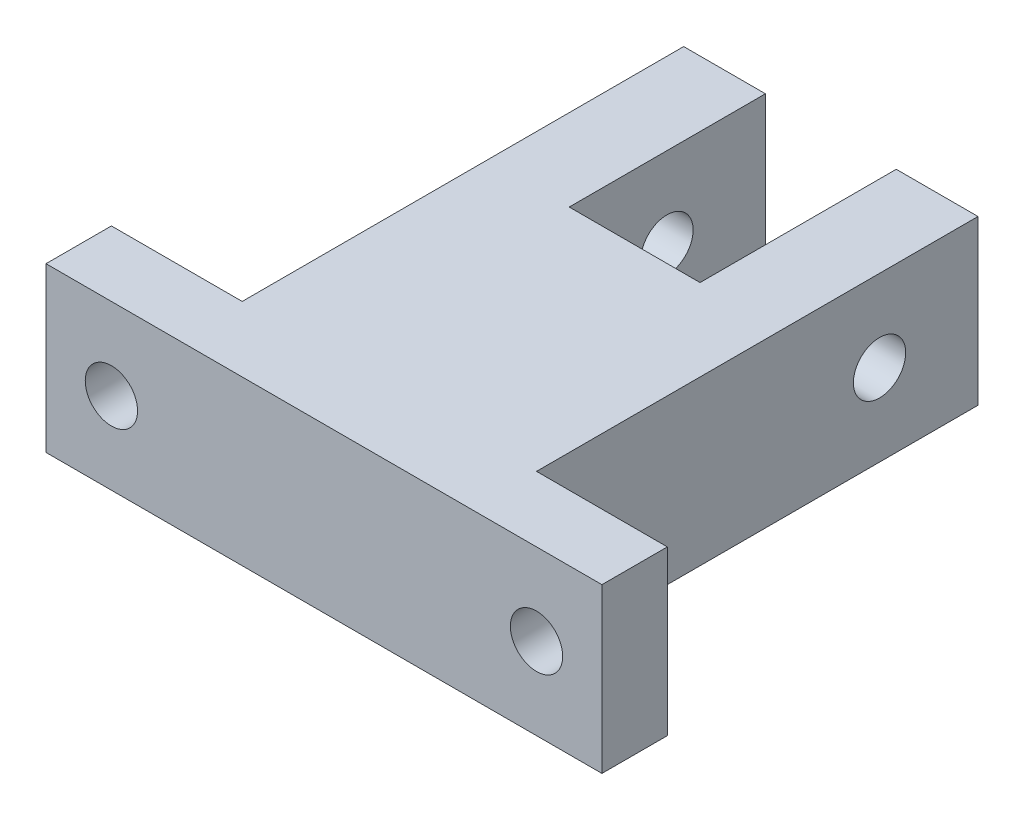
from build123d import *

# Parameters (mm, degrees)
BOSS_EXTRUDE1_DEPTH     = 10
CUT_EXTRUDE1_DEPTH      = 1
CUT_EXTRUDE1_DEPTH_BACK = 6
SKETCH3_R               = 1.6
CUT_EXTRUDE2_DEPTH      = 9
CUT_EXTRUDE2_DEPTH_BACK = 9
SKETCH4_R               = 1.6


with BuildPart() as part:
    # Sketch2 → Boss-Extrude1 (new body)
    with BuildSketch(Plane(origin=(0, 0, 0), x_dir=(1, 0, 0), z_dir=(0, 1, 0))):
        Polygon((-17, 0), (17, 0), (17, 4), (9, 4), (9, 31), (4, 31), (4, 19), (-4, 19), (-4, 31), (-9, 31), (-9, 4), (-17, 4), align=None)
    extrude(amount=BOSS_EXTRUDE1_DEPTH)

    # Sketch3 → Cut-Extrude1 (cut, two sides: drawn at the far end of the back side and taken through both)
    with BuildSketch(Plane.XY.offset(-CUT_EXTRUDE1_DEPTH_BACK)):
        with Locations((13, 5)):
            Circle(SKETCH3_R)
        with Locations((-13, 5)):
            Circle(SKETCH3_R)
    extrude(amount=CUT_EXTRUDE1_DEPTH + CUT_EXTRUDE1_DEPTH_BACK, mode=Mode.SUBTRACT)

    # Sketch4 → Cut-Extrude2 (cut, two sides: drawn at the far end of the back side and taken through both)
    with BuildSketch(Plane(origin=(0, 0, 0), x_dir=(0, 0, -1), z_dir=(1, 0, 0)).offset(-CUT_EXTRUDE2_DEPTH_BACK)):
        with Locations(Location((24.978148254, 5, 0), (0, 0, 180))):
            Circle(SKETCH4_R)
    extrude(amount=CUT_EXTRUDE2_DEPTH + CUT_EXTRUDE2_DEPTH_BACK, mode=Mode.SUBTRACT)


solid = part.part
